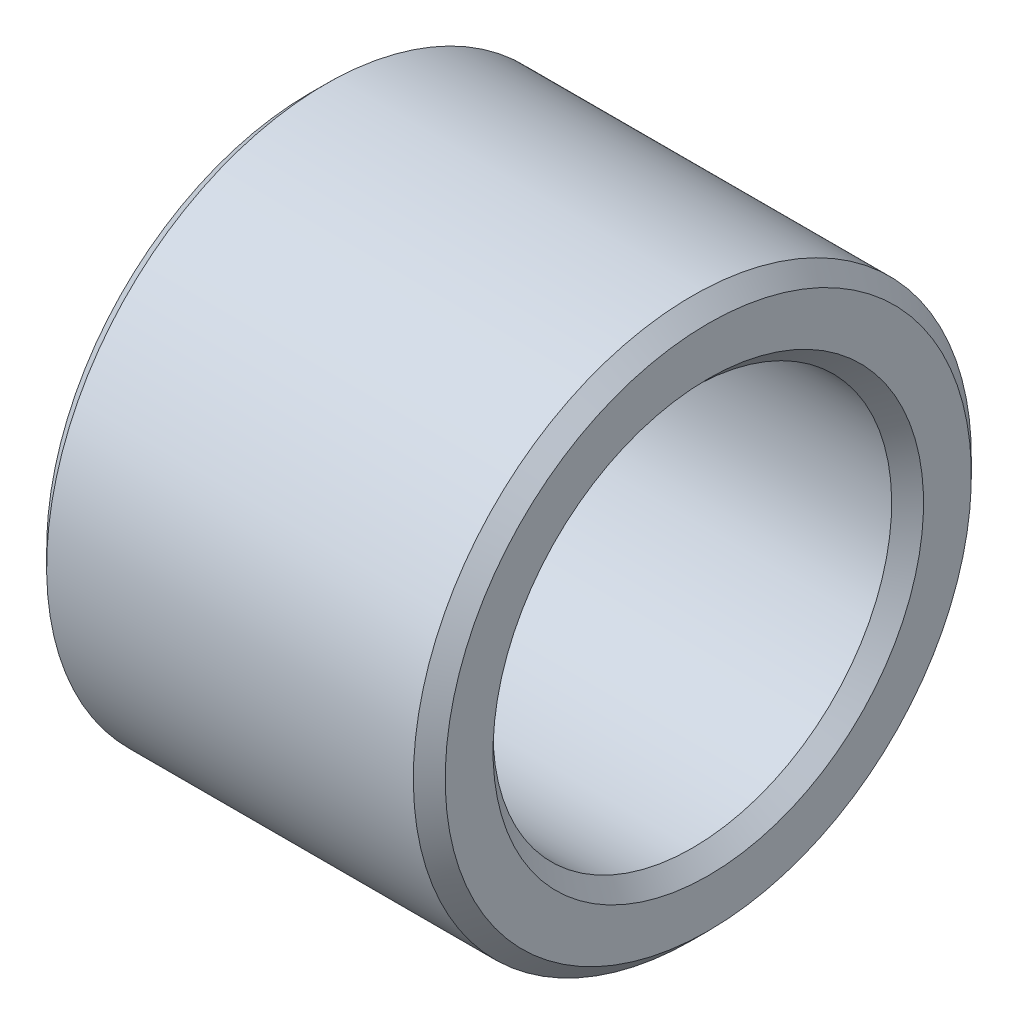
ISO-10303-21;
HEADER;
FILE_DESCRIPTION(('STEP AP214'),'2;1');
FILE_NAME('part.step','',(''),(''),'','','');
FILE_SCHEMA(('AUTOMOTIVE_DESIGN { 1 0 10303 214 1 1 1 1 }'));
ENDSEC;
DATA;
#1=APPLICATION_CONTEXT('core data for automotive mechanical design processes');
#2=APPLICATION_PROTOCOL_DEFINITION('international standard','automotive_design',2000,#1);
#3=PRODUCT_CONTEXT('',#1,'mechanical');
#4=PRODUCT('Part','Part','',(#3));
#5=PRODUCT_RELATED_PRODUCT_CATEGORY('part','',(#4));
#6=PRODUCT_DEFINITION_FORMATION('','',#4);
#7=PRODUCT_DEFINITION_CONTEXT('part definition',#1,'design');
#8=PRODUCT_DEFINITION('design','',#6,#7);
#9=PRODUCT_DEFINITION_SHAPE('','',#8);
#10=(LENGTH_UNIT() NAMED_UNIT(*) SI_UNIT(.MILLI.,.METRE.));
#11=(NAMED_UNIT(*) PLANE_ANGLE_UNIT() SI_UNIT($,.RADIAN.));
#12=(NAMED_UNIT(*) SI_UNIT($,.STERADIAN.) SOLID_ANGLE_UNIT());
#13=UNCERTAINTY_MEASURE_WITH_UNIT(LENGTH_MEASURE(1.E-05),#10,'distance_accuracy_value','');
#14=(GEOMETRIC_REPRESENTATION_CONTEXT(3) GLOBAL_UNCERTAINTY_ASSIGNED_CONTEXT((#13)) GLOBAL_UNIT_ASSIGNED_CONTEXT((#10,
#11,#12)) REPRESENTATION_CONTEXT('',''));
#15=CARTESIAN_POINT('',(0.,0.,0.));
#16=DIRECTION('',(0.,0.,1.));
#17=DIRECTION('',(1.,0.,0.));
#18=AXIS2_PLACEMENT_3D('',#15,#16,#17);
#19=CARTESIAN_POINT('',(0.,-6.,0.));
#20=DIRECTION('',(-1.,0.,0.));
#21=DIRECTION('',(0.,1.,0.));
#22=AXIS2_PLACEMENT_3D('',#19,#20,#21);
#23=PLANE('',#22);
#24=CARTESIAN_POINT('',(0.,0.,0.));
#25=DIRECTION('',(1.,0.,0.));
#26=DIRECTION('',(0.,-1.,0.));
#27=AXIS2_PLACEMENT_3D('',#24,#25,#26);
#28=CIRCLE('',#27,5.4);
#29=CARTESIAN_POINT('',(0.,-5.4,0.));
#30=VERTEX_POINT('',#29);
#31=EDGE_CURVE('E9',#30,#30,#28,.T.);
#32=ORIENTED_EDGE('',*,*,#31,.T.);
#33=EDGE_LOOP('',(#32));
#34=FACE_BOUND('',#33,.T.);
#35=CARTESIAN_POINT('',(0.,0.,0.));
#36=DIRECTION('',(1.,0.,0.));
#37=DIRECTION('',(0.,-1.,0.));
#38=AXIS2_PLACEMENT_3D('',#35,#36,#37);
#39=CIRCLE('',#38,6.6);
#40=CARTESIAN_POINT('',(0.,-6.6,0.));
#41=VERTEX_POINT('',#40);
#42=EDGE_CURVE('E51',#41,#41,#39,.T.);
#43=ORIENTED_EDGE('',*,*,#42,.F.);
#44=EDGE_LOOP('',(#43));
#45=FACE_BOUND('',#44,.T.);
#46=ADVANCED_FACE('F15',(#34,#45),#23,.T.);
#47=CARTESIAN_POINT('',(0.2,0.,0.));
#48=DIRECTION('',(-1.,0.,0.));
#49=DIRECTION('',(0.,-1.,0.));
#50=AXIS2_PLACEMENT_3D('',#47,#48,#49);
#51=CONICAL_SURFACE('',#50,5.2,0.785398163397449);
#52=CARTESIAN_POINT('',(0.4,0.,0.));
#53=DIRECTION('',(1.,0.,0.));
#54=DIRECTION('',(0.,-1.,0.));
#55=AXIS2_PLACEMENT_3D('',#52,#53,#54);
#56=CIRCLE('',#55,5.);
#57=CARTESIAN_POINT('',(0.4,-5.,0.));
#58=VERTEX_POINT('',#57);
#59=EDGE_CURVE('E25',#58,#58,#56,.T.);
#60=ORIENTED_EDGE('',*,*,#59,.T.);
#61=EDGE_LOOP('',(#60));
#62=FACE_BOUND('',#61,.T.);
#63=ORIENTED_EDGE('',*,*,#31,.F.);
#64=EDGE_LOOP('',(#63));
#65=FACE_BOUND('',#64,.T.);
#66=ADVANCED_FACE('F17',(#62,#65),#51,.F.);
#67=CARTESIAN_POINT('',(5.,0.,0.));
#68=DIRECTION('',(-1.,0.,0.));
#69=DIRECTION('',(0.,-1.,0.));
#70=AXIS2_PLACEMENT_3D('',#67,#68,#69);
#71=CYLINDRICAL_SURFACE('',#70,5.);
#72=CARTESIAN_POINT('',(9.6,0.,0.));
#73=DIRECTION('',(1.,0.,0.));
#74=DIRECTION('',(0.,-1.,0.));
#75=AXIS2_PLACEMENT_3D('',#72,#73,#74);
#76=CIRCLE('',#75,5.);
#77=CARTESIAN_POINT('',(9.6,-5.,0.));
#78=VERTEX_POINT('',#77);
#79=EDGE_CURVE('E60',#78,#78,#76,.T.);
#80=ORIENTED_EDGE('',*,*,#79,.T.);
#81=EDGE_LOOP('',(#80));
#82=FACE_BOUND('',#81,.T.);
#83=ORIENTED_EDGE('',*,*,#59,.F.);
#84=EDGE_LOOP('',(#83));
#85=FACE_BOUND('',#84,.T.);
#86=ADVANCED_FACE('F81',(#82,#85),#71,.F.);
#87=CARTESIAN_POINT('',(9.8,0.,0.));
#88=DIRECTION('',(1.,0.,0.));
#89=DIRECTION('',(0.,-1.,0.));
#90=AXIS2_PLACEMENT_3D('',#87,#88,#89);
#91=CONICAL_SURFACE('',#90,5.2,0.785398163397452);
#92=CARTESIAN_POINT('',(10.,0.,0.));
#93=DIRECTION('',(1.,0.,0.));
#94=DIRECTION('',(0.,-1.,0.));
#95=AXIS2_PLACEMENT_3D('',#92,#93,#94);
#96=CIRCLE('',#95,5.4);
#97=CARTESIAN_POINT('',(10.,-5.4,0.));
#98=VERTEX_POINT('',#97);
#99=EDGE_CURVE('E19',#98,#98,#96,.T.);
#100=ORIENTED_EDGE('',*,*,#99,.T.);
#101=EDGE_LOOP('',(#100));
#102=FACE_BOUND('',#101,.T.);
#103=ORIENTED_EDGE('',*,*,#79,.F.);
#104=EDGE_LOOP('',(#103));
#105=FACE_BOUND('',#104,.T.);
#106=ADVANCED_FACE('F67',(#102,#105),#91,.F.);
#107=CARTESIAN_POINT('',(10.,-6.,0.));
#108=DIRECTION('',(1.,0.,0.));
#109=DIRECTION('',(0.,-1.,0.));
#110=AXIS2_PLACEMENT_3D('',#107,#108,#109);
#111=PLANE('',#110);
#112=CARTESIAN_POINT('',(10.,0.,0.));
#113=DIRECTION('',(1.,0.,0.));
#114=DIRECTION('',(0.,-1.,0.));
#115=AXIS2_PLACEMENT_3D('',#112,#113,#114);
#116=CIRCLE('',#115,6.6);
#117=CARTESIAN_POINT('',(10.,-6.6,0.));
#118=VERTEX_POINT('',#117);
#119=EDGE_CURVE('E58',#118,#118,#116,.T.);
#120=ORIENTED_EDGE('',*,*,#119,.T.);
#121=EDGE_LOOP('',(#120));
#122=FACE_BOUND('',#121,.T.);
#123=ORIENTED_EDGE('',*,*,#99,.F.);
#124=EDGE_LOOP('',(#123));
#125=FACE_BOUND('',#124,.T.);
#126=ADVANCED_FACE('F70',(#122,#125),#111,.T.);
#127=CARTESIAN_POINT('',(9.8,0.,0.));
#128=DIRECTION('',(-1.,0.,0.));
#129=DIRECTION('',(0.,-1.,0.));
#130=AXIS2_PLACEMENT_3D('',#127,#128,#129);
#131=CONICAL_SURFACE('',#130,6.8,0.785398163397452);
#132=CARTESIAN_POINT('',(9.6,0.,0.));
#133=DIRECTION('',(1.,0.,0.));
#134=DIRECTION('',(0.,-1.,0.));
#135=AXIS2_PLACEMENT_3D('',#132,#133,#134);
#136=CIRCLE('',#135,7.);
#137=CARTESIAN_POINT('',(9.6,-7.,0.));
#138=VERTEX_POINT('',#137);
#139=EDGE_CURVE('E53',#138,#138,#136,.T.);
#140=ORIENTED_EDGE('',*,*,#139,.T.);
#141=EDGE_LOOP('',(#140));
#142=FACE_BOUND('',#141,.T.);
#143=ORIENTED_EDGE('',*,*,#119,.F.);
#144=EDGE_LOOP('',(#143));
#145=FACE_BOUND('',#144,.T.);
#146=ADVANCED_FACE('F72',(#142,#145),#131,.T.);
#147=CARTESIAN_POINT('',(5.,0.,0.));
#148=DIRECTION('',(-1.,0.,0.));
#149=DIRECTION('',(0.,-1.,0.));
#150=AXIS2_PLACEMENT_3D('',#147,#148,#149);
#151=CYLINDRICAL_SURFACE('',#150,7.);
#152=CARTESIAN_POINT('',(0.4,0.,0.));
#153=DIRECTION('',(1.,0.,0.));
#154=DIRECTION('',(0.,-1.,0.));
#155=AXIS2_PLACEMENT_3D('',#152,#153,#154);
#156=CIRCLE('',#155,7.);
#157=CARTESIAN_POINT('',(0.4,-7.,0.));
#158=VERTEX_POINT('',#157);
#159=EDGE_CURVE('E47',#158,#158,#156,.T.);
#160=ORIENTED_EDGE('',*,*,#159,.T.);
#161=EDGE_LOOP('',(#160));
#162=FACE_BOUND('',#161,.T.);
#163=ORIENTED_EDGE('',*,*,#139,.F.);
#164=EDGE_LOOP('',(#163));
#165=FACE_BOUND('',#164,.T.);
#166=ADVANCED_FACE('F48',(#162,#165),#151,.T.);
#167=CARTESIAN_POINT('',(0.2,0.,0.));
#168=DIRECTION('',(1.,0.,0.));
#169=DIRECTION('',(0.,-1.,0.));
#170=AXIS2_PLACEMENT_3D('',#167,#168,#169);
#171=CONICAL_SURFACE('',#170,6.8,0.785398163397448);
#172=ORIENTED_EDGE('',*,*,#42,.T.);
#173=EDGE_LOOP('',(#172));
#174=FACE_BOUND('',#173,.T.);
#175=ORIENTED_EDGE('',*,*,#159,.F.);
#176=EDGE_LOOP('',(#175));
#177=FACE_BOUND('',#176,.T.);
#178=ADVANCED_FACE('F129',(#174,#177),#171,.T.);
#179=CLOSED_SHELL('',(#46,#66,#86,#106,#126,#146,#166,#178));
#180=MANIFOLD_SOLID_BREP('B1',#179);
#181=ADVANCED_BREP_SHAPE_REPRESENTATION('',(#18,#180),#14);
#182=SHAPE_DEFINITION_REPRESENTATION(#9,#181);
ENDSEC;
END-ISO-10303-21;
